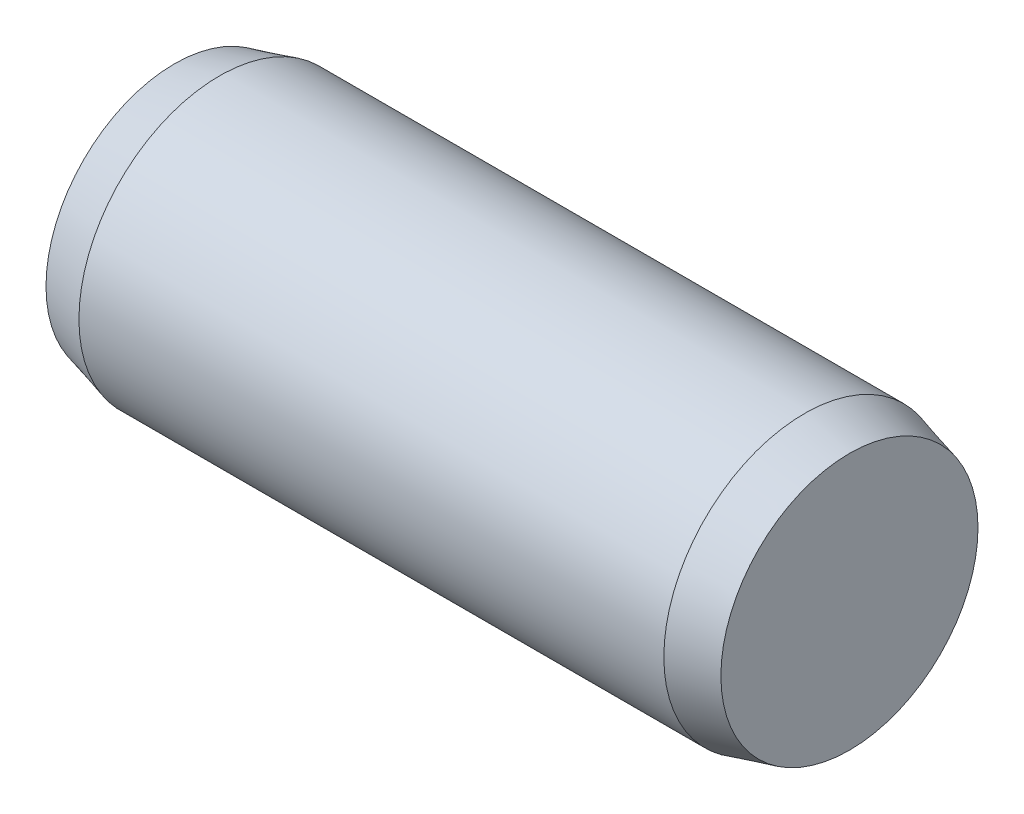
from build123d import *


with BuildPart() as part:
    # Sketch1 → Base-Revolve (revolve)
    with BuildSketch(Plane.XY, mode=Mode.PRIVATE) as base_revolve_sk:
        Polygon((0, 0), (12, 0), (12, 2.285640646), (11.2, 2.5), (0.8, 2.5), (0, 2.285640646), align=None)
    revolve(base_revolve_sk.sketch.rotate(Axis((-6.35, 0, 0), (1, 0, 0)), 90), axis=Axis((-6.35, 0, 0), (1, 0, 0)))


solid = part.part
